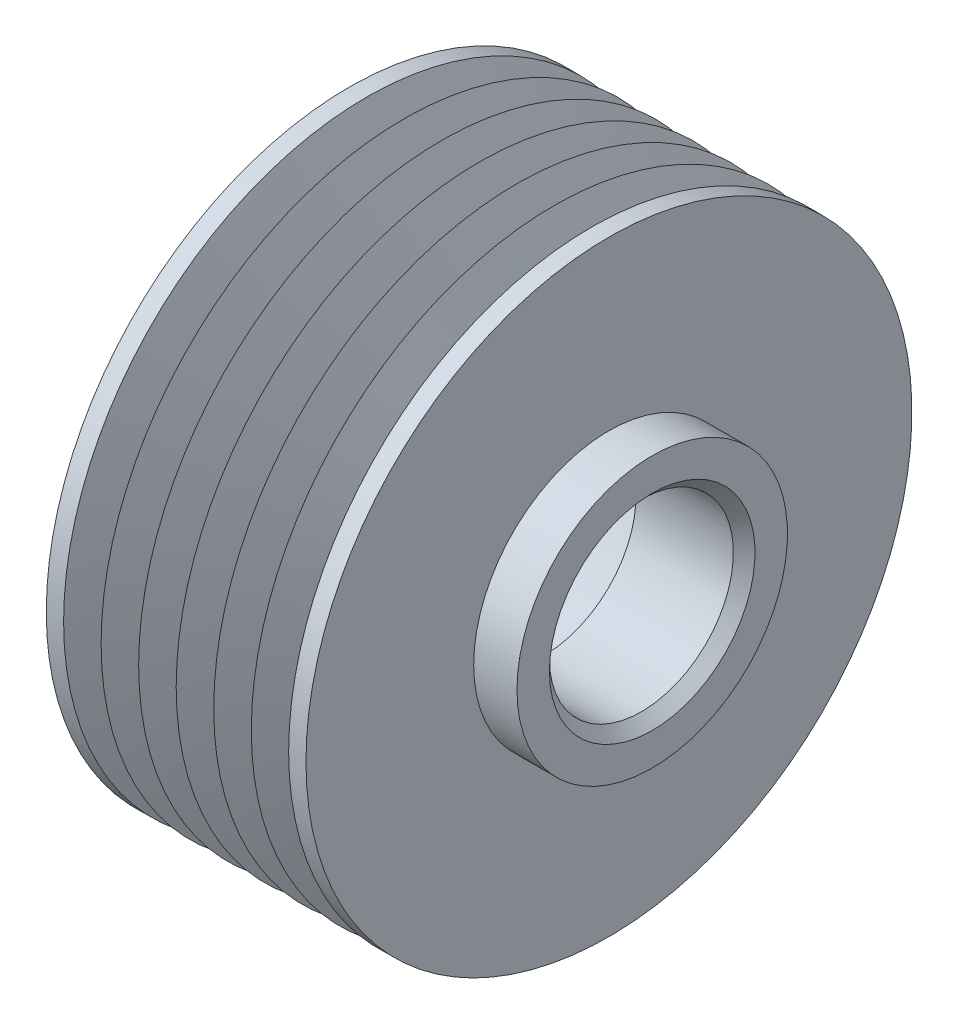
ISO-10303-21;
HEADER;
FILE_DESCRIPTION(('STEP AP214'),'2;1');
FILE_NAME('part.step','',(''),(''),'','','');
FILE_SCHEMA(('AUTOMOTIVE_DESIGN { 1 0 10303 214 1 1 1 1 }'));
ENDSEC;
DATA;
#1=APPLICATION_CONTEXT('core data for automotive mechanical design processes');
#2=APPLICATION_PROTOCOL_DEFINITION('international standard','automotive_design',2000,#1);
#3=PRODUCT_CONTEXT('',#1,'mechanical');
#4=PRODUCT('Part','Part','',(#3));
#5=PRODUCT_RELATED_PRODUCT_CATEGORY('part','',(#4));
#6=PRODUCT_DEFINITION_FORMATION('','',#4);
#7=PRODUCT_DEFINITION_CONTEXT('part definition',#1,'design');
#8=PRODUCT_DEFINITION('design','',#6,#7);
#9=PRODUCT_DEFINITION_SHAPE('','',#8);
#10=(LENGTH_UNIT() NAMED_UNIT(*) SI_UNIT(.MILLI.,.METRE.));
#11=(NAMED_UNIT(*) PLANE_ANGLE_UNIT() SI_UNIT($,.RADIAN.));
#12=(NAMED_UNIT(*) SI_UNIT($,.STERADIAN.) SOLID_ANGLE_UNIT());
#13=UNCERTAINTY_MEASURE_WITH_UNIT(LENGTH_MEASURE(1.E-05),#10,'distance_accuracy_value','');
#14=(GEOMETRIC_REPRESENTATION_CONTEXT(3) GLOBAL_UNCERTAINTY_ASSIGNED_CONTEXT((#13)) GLOBAL_UNIT_ASSIGNED_CONTEXT((#10,
#11,#12)) REPRESENTATION_CONTEXT('',''));
#15=CARTESIAN_POINT('',(0.,0.,0.));
#16=DIRECTION('',(0.,0.,1.));
#17=DIRECTION('',(1.,0.,0.));
#18=AXIS2_PLACEMENT_3D('',#15,#16,#17);
#19=CARTESIAN_POINT('',(0.,0.,0.));
#20=DIRECTION('',(-1.,0.,0.));
#21=DIRECTION('',(0.,0.,1.));
#22=AXIS2_PLACEMENT_3D('',#19,#20,#21);
#23=CONICAL_SURFACE('',#22,20.,0.785398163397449);
#24=CARTESIAN_POINT('',(2.,0.,0.));
#25=DIRECTION('',(-1.,0.,0.));
#26=DIRECTION('',(0.,0.,1.));
#27=AXIS2_PLACEMENT_3D('',#24,#25,#26);
#28=CIRCLE('',#27,18.);
#29=CARTESIAN_POINT('',(2.,0.,18.));
#30=VERTEX_POINT('',#29);
#31=EDGE_CURVE('E106',#30,#30,#28,.T.);
#32=ORIENTED_EDGE('',*,*,#31,.F.);
#33=EDGE_LOOP('',(#32));
#34=FACE_BOUND('',#33,.T.);
#35=CARTESIAN_POINT('',(0.,0.,0.));
#36=DIRECTION('',(-1.,0.,0.));
#37=DIRECTION('',(0.,0.,1.));
#38=AXIS2_PLACEMENT_3D('',#35,#36,#37);
#39=CIRCLE('',#38,20.);
#40=CARTESIAN_POINT('',(0.,0.,20.));
#41=VERTEX_POINT('',#40);
#42=EDGE_CURVE('E40',#41,#41,#39,.T.);
#43=ORIENTED_EDGE('',*,*,#42,.T.);
#44=EDGE_LOOP('',(#43));
#45=FACE_BOUND('',#44,.T.);
#46=ADVANCED_FACE('F29',(#34,#45),#23,.F.);
#47=CARTESIAN_POINT('',(0.,20.,0.));
#48=DIRECTION('',(1.,0.,0.));
#49=DIRECTION('',(0.,0.,-1.));
#50=AXIS2_PLACEMENT_3D('',#47,#48,#49);
#51=PLANE('',#50);
#52=ORIENTED_EDGE('',*,*,#42,.F.);
#53=EDGE_LOOP('',(#52));
#54=FACE_BOUND('',#53,.T.);
#55=CARTESIAN_POINT('',(0.,0.,0.));
#56=DIRECTION('',(-1.,0.,0.));
#57=DIRECTION('',(0.,0.,1.));
#58=AXIS2_PLACEMENT_3D('',#55,#56,#57);
#59=CIRCLE('',#58,28.);
#60=CARTESIAN_POINT('',(0.,0.,28.));
#61=VERTEX_POINT('',#60);
#62=EDGE_CURVE('E44',#61,#61,#59,.T.);
#63=ORIENTED_EDGE('',*,*,#62,.T.);
#64=EDGE_LOOP('',(#63));
#65=FACE_BOUND('',#64,.T.);
#66=ADVANCED_FACE('F114',(#54,#65),#51,.F.);
#67=CARTESIAN_POINT('',(-10.,0.,0.));
#68=DIRECTION('',(-1.,0.,0.));
#69=DIRECTION('',(0.,0.,1.));
#70=AXIS2_PLACEMENT_3D('',#67,#68,#69);
#71=CYLINDRICAL_SURFACE('',#70,28.);
#72=ORIENTED_EDGE('',*,*,#62,.F.);
#73=EDGE_LOOP('',(#72));
#74=FACE_BOUND('',#73,.T.);
#75=CARTESIAN_POINT('',(1.6,0.,0.));
#76=DIRECTION('',(-1.,0.,0.));
#77=DIRECTION('',(0.,0.,1.));
#78=AXIS2_PLACEMENT_3D('',#75,#76,#77);
#79=CIRCLE('',#78,28.);
#80=CARTESIAN_POINT('',(1.6,0.,28.));
#81=VERTEX_POINT('',#80);
#82=EDGE_CURVE('E49',#81,#81,#79,.T.);
#83=ORIENTED_EDGE('',*,*,#82,.T.);
#84=EDGE_LOOP('',(#83));
#85=FACE_BOUND('',#84,.T.);
#86=ADVANCED_FACE('F119',(#74,#85),#71,.T.);
#87=CARTESIAN_POINT('',(3.30112740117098,0.,0.));
#88=DIRECTION('',(-1.,0.,0.));
#89=DIRECTION('',(0.,0.,1.));
#90=AXIS2_PLACEMENT_3D('',#87,#88,#89);
#91=CONICAL_SURFACE('',#90,23.5,1.2093733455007);
#92=ORIENTED_EDGE('',*,*,#82,.F.);
#93=EDGE_LOOP('',(#92));
#94=FACE_BOUND('',#93,.T.);
#95=CARTESIAN_POINT('',(3.30112740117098,0.,0.));
#96=DIRECTION('',(-1.,0.,0.));
#97=DIRECTION('',(0.,0.,1.));
#98=AXIS2_PLACEMENT_3D('',#95,#96,#97);
#99=CIRCLE('',#98,23.5);
#100=CARTESIAN_POINT('',(3.30112740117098,0.,23.5));
#101=VERTEX_POINT('',#100);
#102=EDGE_CURVE('E52',#101,#101,#99,.T.);
#103=ORIENTED_EDGE('',*,*,#102,.T.);
#104=EDGE_LOOP('',(#103));
#105=FACE_BOUND('',#104,.T.);
#106=ADVANCED_FACE('F125',(#94,#105),#91,.T.);
#107=CARTESIAN_POINT('',(5.06666666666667,0.,0.));
#108=DIRECTION('',(1.,0.,0.));
#109=DIRECTION('',(0.,0.,-1.));
#110=AXIS2_PLACEMENT_3D('',#107,#108,#109);
#111=CONICAL_SURFACE('',#110,28.,1.19690900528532);
#112=ORIENTED_EDGE('',*,*,#102,.F.);
#113=EDGE_LOOP('',(#112));
#114=FACE_BOUND('',#113,.T.);
#115=CARTESIAN_POINT('',(5.06666666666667,0.,0.));
#116=DIRECTION('',(-1.,0.,0.));
#117=DIRECTION('',(0.,0.,1.));
#118=AXIS2_PLACEMENT_3D('',#115,#116,#117);
#119=CIRCLE('',#118,28.);
#120=CARTESIAN_POINT('',(5.06666666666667,0.,28.));
#121=VERTEX_POINT('',#120);
#122=EDGE_CURVE('E55',#121,#121,#119,.T.);
#123=ORIENTED_EDGE('',*,*,#122,.T.);
#124=EDGE_LOOP('',(#123));
#125=FACE_BOUND('',#124,.T.);
#126=ADVANCED_FACE('F131',(#114,#125),#111,.T.);
#127=CARTESIAN_POINT('',(6.77112740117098,0.,0.));
#128=DIRECTION('',(-1.,0.,0.));
#129=DIRECTION('',(0.,0.,1.));
#130=AXIS2_PLACEMENT_3D('',#127,#128,#129);
#131=CONICAL_SURFACE('',#130,23.5,1.2087253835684);
#132=ORIENTED_EDGE('',*,*,#122,.F.);
#133=EDGE_LOOP('',(#132));
#134=FACE_BOUND('',#133,.T.);
#135=CARTESIAN_POINT('',(6.77112740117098,0.,0.));
#136=DIRECTION('',(-1.,0.,0.));
#137=DIRECTION('',(0.,0.,1.));
#138=AXIS2_PLACEMENT_3D('',#135,#136,#137);
#139=CIRCLE('',#138,23.5);
#140=CARTESIAN_POINT('',(6.77112740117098,0.,23.5));
#141=VERTEX_POINT('',#140);
#142=EDGE_CURVE('E58',#141,#141,#139,.T.);
#143=ORIENTED_EDGE('',*,*,#142,.T.);
#144=EDGE_LOOP('',(#143));
#145=FACE_BOUND('',#144,.T.);
#146=ADVANCED_FACE('F137',(#134,#145),#131,.T.);
#147=CARTESIAN_POINT('',(8.53666666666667,0.,0.));
#148=DIRECTION('',(1.,0.,0.));
#149=DIRECTION('',(0.,0.,-1.));
#150=AXIS2_PLACEMENT_3D('',#147,#148,#149);
#151=CONICAL_SURFACE('',#150,28.,1.19690900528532);
#152=ORIENTED_EDGE('',*,*,#142,.F.);
#153=EDGE_LOOP('',(#152));
#154=FACE_BOUND('',#153,.T.);
#155=CARTESIAN_POINT('',(8.53666666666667,0.,0.));
#156=DIRECTION('',(-1.,0.,0.));
#157=DIRECTION('',(0.,0.,1.));
#158=AXIS2_PLACEMENT_3D('',#155,#156,#157);
#159=CIRCLE('',#158,28.);
#160=CARTESIAN_POINT('',(8.53666666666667,0.,28.));
#161=VERTEX_POINT('',#160);
#162=EDGE_CURVE('E61',#161,#161,#159,.T.);
#163=ORIENTED_EDGE('',*,*,#162,.T.);
#164=EDGE_LOOP('',(#163));
#165=FACE_BOUND('',#164,.T.);
#166=ADVANCED_FACE('F143',(#154,#165),#151,.T.);
#167=CARTESIAN_POINT('',(10.241127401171,0.,0.));
#168=DIRECTION('',(-1.,0.,0.));
#169=DIRECTION('',(0.,0.,1.));
#170=AXIS2_PLACEMENT_3D('',#167,#168,#169);
#171=CONICAL_SURFACE('',#170,23.5,1.2087253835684);
#172=ORIENTED_EDGE('',*,*,#162,.F.);
#173=EDGE_LOOP('',(#172));
#174=FACE_BOUND('',#173,.T.);
#175=CARTESIAN_POINT('',(10.241127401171,0.,0.));
#176=DIRECTION('',(-1.,0.,0.));
#177=DIRECTION('',(0.,0.,1.));
#178=AXIS2_PLACEMENT_3D('',#175,#176,#177);
#179=CIRCLE('',#178,23.5);
#180=CARTESIAN_POINT('',(10.241127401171,0.,23.5));
#181=VERTEX_POINT('',#180);
#182=EDGE_CURVE('E64',#181,#181,#179,.T.);
#183=ORIENTED_EDGE('',*,*,#182,.T.);
#184=EDGE_LOOP('',(#183));
#185=FACE_BOUND('',#184,.T.);
#186=ADVANCED_FACE('F149',(#174,#185),#171,.T.);
#187=CARTESIAN_POINT('',(12.0066666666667,0.,0.));
#188=DIRECTION('',(1.,0.,0.));
#189=DIRECTION('',(0.,0.,-1.));
#190=AXIS2_PLACEMENT_3D('',#187,#188,#189);
#191=CONICAL_SURFACE('',#190,28.,1.19690900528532);
#192=ORIENTED_EDGE('',*,*,#182,.F.);
#193=EDGE_LOOP('',(#192));
#194=FACE_BOUND('',#193,.T.);
#195=CARTESIAN_POINT('',(12.0066666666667,0.,0.));
#196=DIRECTION('',(-1.,0.,0.));
#197=DIRECTION('',(0.,0.,1.));
#198=AXIS2_PLACEMENT_3D('',#195,#196,#197);
#199=CIRCLE('',#198,28.);
#200=CARTESIAN_POINT('',(12.0066666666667,0.,28.));
#201=VERTEX_POINT('',#200);
#202=EDGE_CURVE('E67',#201,#201,#199,.T.);
#203=ORIENTED_EDGE('',*,*,#202,.T.);
#204=EDGE_LOOP('',(#203));
#205=FACE_BOUND('',#204,.T.);
#206=ADVANCED_FACE('F155',(#194,#205),#191,.T.);
#207=CARTESIAN_POINT('',(13.711127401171,0.,0.));
#208=DIRECTION('',(-1.,0.,0.));
#209=DIRECTION('',(0.,0.,1.));
#210=AXIS2_PLACEMENT_3D('',#207,#208,#209);
#211=CONICAL_SURFACE('',#210,23.5,1.2087253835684);
#212=ORIENTED_EDGE('',*,*,#202,.F.);
#213=EDGE_LOOP('',(#212));
#214=FACE_BOUND('',#213,.T.);
#215=CARTESIAN_POINT('',(13.711127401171,0.,0.));
#216=DIRECTION('',(-1.,0.,0.));
#217=DIRECTION('',(0.,0.,1.));
#218=AXIS2_PLACEMENT_3D('',#215,#216,#217);
#219=CIRCLE('',#218,23.5);
#220=CARTESIAN_POINT('',(13.711127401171,0.,23.5));
#221=VERTEX_POINT('',#220);
#222=EDGE_CURVE('E70',#221,#221,#219,.T.);
#223=ORIENTED_EDGE('',*,*,#222,.T.);
#224=EDGE_LOOP('',(#223));
#225=FACE_BOUND('',#224,.T.);
#226=ADVANCED_FACE('F161',(#214,#225),#211,.T.);
#227=CARTESIAN_POINT('',(15.4766666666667,0.,0.));
#228=DIRECTION('',(1.,0.,0.));
#229=DIRECTION('',(0.,0.,-1.));
#230=AXIS2_PLACEMENT_3D('',#227,#228,#229);
#231=CONICAL_SURFACE('',#230,28.,1.19690900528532);
#232=ORIENTED_EDGE('',*,*,#222,.F.);
#233=EDGE_LOOP('',(#232));
#234=FACE_BOUND('',#233,.T.);
#235=CARTESIAN_POINT('',(15.4766666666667,0.,0.));
#236=DIRECTION('',(-1.,0.,0.));
#237=DIRECTION('',(0.,0.,1.));
#238=AXIS2_PLACEMENT_3D('',#235,#236,#237);
#239=CIRCLE('',#238,28.);
#240=CARTESIAN_POINT('',(15.4766666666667,0.,28.));
#241=VERTEX_POINT('',#240);
#242=EDGE_CURVE('E73',#241,#241,#239,.T.);
#243=ORIENTED_EDGE('',*,*,#242,.T.);
#244=EDGE_LOOP('',(#243));
#245=FACE_BOUND('',#244,.T.);
#246=ADVANCED_FACE('F167',(#234,#245),#231,.T.);
#247=CARTESIAN_POINT('',(17.181127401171,0.,0.));
#248=DIRECTION('',(-1.,0.,0.));
#249=DIRECTION('',(0.,0.,1.));
#250=AXIS2_PLACEMENT_3D('',#247,#248,#249);
#251=CONICAL_SURFACE('',#250,23.5,1.2087253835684);
#252=ORIENTED_EDGE('',*,*,#242,.F.);
#253=EDGE_LOOP('',(#252));
#254=FACE_BOUND('',#253,.T.);
#255=CARTESIAN_POINT('',(17.181127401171,0.,0.));
#256=DIRECTION('',(-1.,0.,0.));
#257=DIRECTION('',(0.,0.,1.));
#258=AXIS2_PLACEMENT_3D('',#255,#256,#257);
#259=CIRCLE('',#258,23.5);
#260=CARTESIAN_POINT('',(17.181127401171,0.,23.5));
#261=VERTEX_POINT('',#260);
#262=EDGE_CURVE('E76',#261,#261,#259,.T.);
#263=ORIENTED_EDGE('',*,*,#262,.T.);
#264=EDGE_LOOP('',(#263));
#265=FACE_BOUND('',#264,.T.);
#266=ADVANCED_FACE('F173',(#254,#265),#251,.T.);
#267=CARTESIAN_POINT('',(18.9466666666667,0.,0.));
#268=DIRECTION('',(1.,0.,0.));
#269=DIRECTION('',(0.,0.,-1.));
#270=AXIS2_PLACEMENT_3D('',#267,#268,#269);
#271=CONICAL_SURFACE('',#270,28.,1.19690900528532);
#272=ORIENTED_EDGE('',*,*,#262,.F.);
#273=EDGE_LOOP('',(#272));
#274=FACE_BOUND('',#273,.T.);
#275=CARTESIAN_POINT('',(18.9466666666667,0.,0.));
#276=DIRECTION('',(-1.,0.,0.));
#277=DIRECTION('',(0.,0.,1.));
#278=AXIS2_PLACEMENT_3D('',#275,#276,#277);
#279=CIRCLE('',#278,28.);
#280=CARTESIAN_POINT('',(18.9466666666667,0.,28.));
#281=VERTEX_POINT('',#280);
#282=EDGE_CURVE('E79',#281,#281,#279,.T.);
#283=ORIENTED_EDGE('',*,*,#282,.T.);
#284=EDGE_LOOP('',(#283));
#285=FACE_BOUND('',#284,.T.);
#286=ADVANCED_FACE('F179',(#274,#285),#271,.T.);
#287=CARTESIAN_POINT('',(20.891127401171,0.,0.));
#288=DIRECTION('',(-1.,0.,0.));
#289=DIRECTION('',(0.,0.,1.));
#290=AXIS2_PLACEMENT_3D('',#287,#288,#289);
#291=CONICAL_SURFACE('',#290,23.5,1.1629253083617);
#292=ORIENTED_EDGE('',*,*,#282,.F.);
#293=EDGE_LOOP('',(#292));
#294=FACE_BOUND('',#293,.T.);
#295=CARTESIAN_POINT('',(20.891127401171,0.,0.));
#296=DIRECTION('',(-1.,0.,0.));
#297=DIRECTION('',(0.,0.,1.));
#298=AXIS2_PLACEMENT_3D('',#295,#296,#297);
#299=CIRCLE('',#298,23.5);
#300=CARTESIAN_POINT('',(20.891127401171,0.,23.5));
#301=VERTEX_POINT('',#300);
#302=EDGE_CURVE('E82',#301,#301,#299,.T.);
#303=ORIENTED_EDGE('',*,*,#302,.T.);
#304=EDGE_LOOP('',(#303));
#305=FACE_BOUND('',#304,.T.);
#306=ADVANCED_FACE('F185',(#294,#305),#291,.T.);
#307=CARTESIAN_POINT('',(22.4,0.,0.));
#308=DIRECTION('',(1.,0.,0.));
#309=DIRECTION('',(0.,0.,-1.));
#310=AXIS2_PLACEMENT_3D('',#307,#308,#309);
#311=CONICAL_SURFACE('',#310,28.,1.24727230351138);
#312=ORIENTED_EDGE('',*,*,#302,.F.);
#313=EDGE_LOOP('',(#312));
#314=FACE_BOUND('',#313,.T.);
#315=CARTESIAN_POINT('',(22.4,0.,0.));
#316=DIRECTION('',(-1.,0.,0.));
#317=DIRECTION('',(0.,0.,1.));
#318=AXIS2_PLACEMENT_3D('',#315,#316,#317);
#319=CIRCLE('',#318,28.);
#320=CARTESIAN_POINT('',(22.4,0.,28.));
#321=VERTEX_POINT('',#320);
#322=EDGE_CURVE('E85',#321,#321,#319,.T.);
#323=ORIENTED_EDGE('',*,*,#322,.T.);
#324=EDGE_LOOP('',(#323));
#325=FACE_BOUND('',#324,.T.);
#326=ADVANCED_FACE('F191',(#314,#325),#311,.T.);
#327=CARTESIAN_POINT('',(-10.,0.,0.));
#328=DIRECTION('',(-1.,0.,0.));
#329=DIRECTION('',(0.,0.,1.));
#330=AXIS2_PLACEMENT_3D('',#327,#328,#329);
#331=CYLINDRICAL_SURFACE('',#330,28.);
#332=ORIENTED_EDGE('',*,*,#322,.F.);
#333=EDGE_LOOP('',(#332));
#334=FACE_BOUND('',#333,.T.);
#335=CARTESIAN_POINT('',(24.,0.,0.));
#336=DIRECTION('',(-1.,0.,0.));
#337=DIRECTION('',(0.,0.,1.));
#338=AXIS2_PLACEMENT_3D('',#335,#336,#337);
#339=CIRCLE('',#338,28.);
#340=CARTESIAN_POINT('',(24.,0.,28.));
#341=VERTEX_POINT('',#340);
#342=EDGE_CURVE('E88',#341,#341,#339,.T.);
#343=ORIENTED_EDGE('',*,*,#342,.T.);
#344=EDGE_LOOP('',(#343));
#345=FACE_BOUND('',#344,.T.);
#346=ADVANCED_FACE('F197',(#334,#345),#331,.T.);
#347=CARTESIAN_POINT('',(24.,28.,0.));
#348=DIRECTION('',(-1.,0.,0.));
#349=DIRECTION('',(0.,0.,1.));
#350=AXIS2_PLACEMENT_3D('',#347,#348,#349);
#351=PLANE('',#350);
#352=ORIENTED_EDGE('',*,*,#342,.F.);
#353=EDGE_LOOP('',(#352));
#354=FACE_BOUND('',#353,.T.);
#355=CARTESIAN_POINT('',(24.,0.,0.));
#356=DIRECTION('',(-1.,0.,0.));
#357=DIRECTION('',(0.,0.,1.));
#358=AXIS2_PLACEMENT_3D('',#355,#356,#357);
#359=CIRCLE('',#358,12.5);
#360=CARTESIAN_POINT('',(24.,0.,12.5));
#361=VERTEX_POINT('',#360);
#362=EDGE_CURVE('E91',#361,#361,#359,.T.);
#363=ORIENTED_EDGE('',*,*,#362,.T.);
#364=EDGE_LOOP('',(#363));
#365=FACE_BOUND('',#364,.T.);
#366=ADVANCED_FACE('F203',(#354,#365),#351,.F.);
#367=CARTESIAN_POINT('',(-10.,0.,0.));
#368=DIRECTION('',(-1.,0.,0.));
#369=DIRECTION('',(0.,0.,1.));
#370=AXIS2_PLACEMENT_3D('',#367,#368,#369);
#371=CYLINDRICAL_SURFACE('',#370,12.5);
#372=ORIENTED_EDGE('',*,*,#362,.F.);
#373=EDGE_LOOP('',(#372));
#374=FACE_BOUND('',#373,.T.);
#375=CARTESIAN_POINT('',(28.,0.,0.));
#376=DIRECTION('',(-1.,0.,0.));
#377=DIRECTION('',(0.,0.,1.));
#378=AXIS2_PLACEMENT_3D('',#375,#376,#377);
#379=CIRCLE('',#378,12.5);
#380=CARTESIAN_POINT('',(28.,0.,12.5));
#381=VERTEX_POINT('',#380);
#382=EDGE_CURVE('E94',#381,#381,#379,.T.);
#383=ORIENTED_EDGE('',*,*,#382,.T.);
#384=EDGE_LOOP('',(#383));
#385=FACE_BOUND('',#384,.T.);
#386=ADVANCED_FACE('F209',(#374,#385),#371,.T.);
#387=CARTESIAN_POINT('',(28.,12.5,0.));
#388=DIRECTION('',(-1.,0.,0.));
#389=DIRECTION('',(0.,0.,1.));
#390=AXIS2_PLACEMENT_3D('',#387,#388,#389);
#391=PLANE('',#390);
#392=CARTESIAN_POINT('',(28.,0.,0.));
#393=DIRECTION('',(-1.,0.,0.));
#394=DIRECTION('',(0.,0.,1.));
#395=AXIS2_PLACEMENT_3D('',#392,#393,#394);
#396=CIRCLE('',#395,9.5);
#397=CARTESIAN_POINT('',(28.,0.,9.5));
#398=VERTEX_POINT('',#397);
#399=EDGE_CURVE('E36',#398,#398,#396,.T.);
#400=ORIENTED_EDGE('',*,*,#399,.T.);
#401=EDGE_LOOP('',(#400));
#402=FACE_BOUND('',#401,.T.);
#403=ORIENTED_EDGE('',*,*,#382,.F.);
#404=EDGE_LOOP('',(#403));
#405=FACE_BOUND('',#404,.T.);
#406=ADVANCED_FACE('F215',(#402,#405),#391,.F.);
#407=CARTESIAN_POINT('',(-10.,0.,0.));
#408=DIRECTION('',(-1.,0.,0.));
#409=DIRECTION('',(0.,0.,1.));
#410=AXIS2_PLACEMENT_3D('',#407,#408,#409);
#411=CYLINDRICAL_SURFACE('',#410,8.5);
#412=CARTESIAN_POINT('',(27.,0.,0.));
#413=DIRECTION('',(-1.,0.,0.));
#414=DIRECTION('',(0.,0.,1.));
#415=AXIS2_PLACEMENT_3D('',#412,#413,#414);
#416=CIRCLE('',#415,8.5);
#417=CARTESIAN_POINT('',(27.,0.,8.5));
#418=VERTEX_POINT('',#417);
#419=EDGE_CURVE('E10',#418,#418,#416,.F.);
#420=ORIENTED_EDGE('',*,*,#419,.T.);
#421=EDGE_LOOP('',(#420));
#422=FACE_BOUND('',#421,.T.);
#423=CARTESIAN_POINT('',(18.,0.,0.));
#424=DIRECTION('',(-1.,0.,0.));
#425=DIRECTION('',(0.,0.,1.));
#426=AXIS2_PLACEMENT_3D('',#423,#424,#425);
#427=CIRCLE('',#426,8.5);
#428=CARTESIAN_POINT('',(18.,0.,8.5));
#429=VERTEX_POINT('',#428);
#430=EDGE_CURVE('E97',#429,#429,#427,.T.);
#431=ORIENTED_EDGE('',*,*,#430,.T.);
#432=EDGE_LOOP('',(#431));
#433=FACE_BOUND('',#432,.T.);
#434=ADVANCED_FACE('F220',(#422,#433),#411,.F.);
#435=CARTESIAN_POINT('',(18.,8.5,0.));
#436=DIRECTION('',(1.,0.,0.));
#437=DIRECTION('',(0.,0.,-1.));
#438=AXIS2_PLACEMENT_3D('',#435,#436,#437);
#439=PLANE('',#438);
#440=ORIENTED_EDGE('',*,*,#430,.F.);
#441=EDGE_LOOP('',(#440));
#442=FACE_BOUND('',#441,.T.);
#443=CARTESIAN_POINT('',(18.,0.,0.));
#444=DIRECTION('',(-1.,0.,0.));
#445=DIRECTION('',(0.,0.,1.));
#446=AXIS2_PLACEMENT_3D('',#443,#444,#445);
#447=CIRCLE('',#446,15.);
#448=CARTESIAN_POINT('',(18.,0.,15.));
#449=VERTEX_POINT('',#448);
#450=EDGE_CURVE('E100',#449,#449,#447,.T.);
#451=ORIENTED_EDGE('',*,*,#450,.T.);
#452=EDGE_LOOP('',(#451));
#453=FACE_BOUND('',#452,.T.);
#454=ADVANCED_FACE('F225',(#442,#453),#439,.F.);
#455=CARTESIAN_POINT('',(15.,0.,0.));
#456=DIRECTION('',(-1.,0.,0.));
#457=DIRECTION('',(0.,0.,1.));
#458=AXIS2_PLACEMENT_3D('',#455,#456,#457);
#459=CONICAL_SURFACE('',#458,18.,0.785398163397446);
#460=ORIENTED_EDGE('',*,*,#450,.F.);
#461=EDGE_LOOP('',(#460));
#462=FACE_BOUND('',#461,.T.);
#463=CARTESIAN_POINT('',(15.,0.,0.));
#464=DIRECTION('',(-1.,0.,0.));
#465=DIRECTION('',(0.,0.,1.));
#466=AXIS2_PLACEMENT_3D('',#463,#464,#465);
#467=CIRCLE('',#466,18.);
#468=CARTESIAN_POINT('',(15.,0.,18.));
#469=VERTEX_POINT('',#468);
#470=EDGE_CURVE('E103',#469,#469,#467,.T.);
#471=ORIENTED_EDGE('',*,*,#470,.T.);
#472=EDGE_LOOP('',(#471));
#473=FACE_BOUND('',#472,.T.);
#474=ADVANCED_FACE('F230',(#462,#473),#459,.F.);
#475=CARTESIAN_POINT('',(-10.,0.,0.));
#476=DIRECTION('',(-1.,0.,0.));
#477=DIRECTION('',(0.,0.,1.));
#478=AXIS2_PLACEMENT_3D('',#475,#476,#477);
#479=CYLINDRICAL_SURFACE('',#478,18.);
#480=ORIENTED_EDGE('',*,*,#470,.F.);
#481=EDGE_LOOP('',(#480));
#482=FACE_BOUND('',#481,.T.);
#483=ORIENTED_EDGE('',*,*,#31,.T.);
#484=EDGE_LOOP('',(#483));
#485=FACE_BOUND('',#484,.T.);
#486=ADVANCED_FACE('F110',(#482,#485),#479,.F.);
#487=CARTESIAN_POINT('',(28.,0.,0.));
#488=DIRECTION('',(1.,0.,0.));
#489=DIRECTION('',(0.,0.,-1.));
#490=AXIS2_PLACEMENT_3D('',#487,#488,#489);
#491=CONICAL_SURFACE('',#490,9.5,0.785398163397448);
#492=ORIENTED_EDGE('',*,*,#419,.F.);
#493=EDGE_LOOP('',(#492));
#494=FACE_BOUND('',#493,.T.);
#495=ORIENTED_EDGE('',*,*,#399,.F.);
#496=EDGE_LOOP('',(#495));
#497=FACE_BOUND('',#496,.T.);
#498=ADVANCED_FACE('F31',(#494,#497),#491,.F.);
#499=CLOSED_SHELL('',(#46,#66,#86,#106,#126,#146,#166,#186,#206,#226,#246,#266,#286,#306,#326,
#346,#366,#386,#406,#434,#454,#474,#486,#498));
#500=MANIFOLD_SOLID_BREP('B2',#499);
#501=ADVANCED_BREP_SHAPE_REPRESENTATION('',(#18,#500),#14);
#502=SHAPE_DEFINITION_REPRESENTATION(#9,#501);
ENDSEC;
END-ISO-10303-21;
